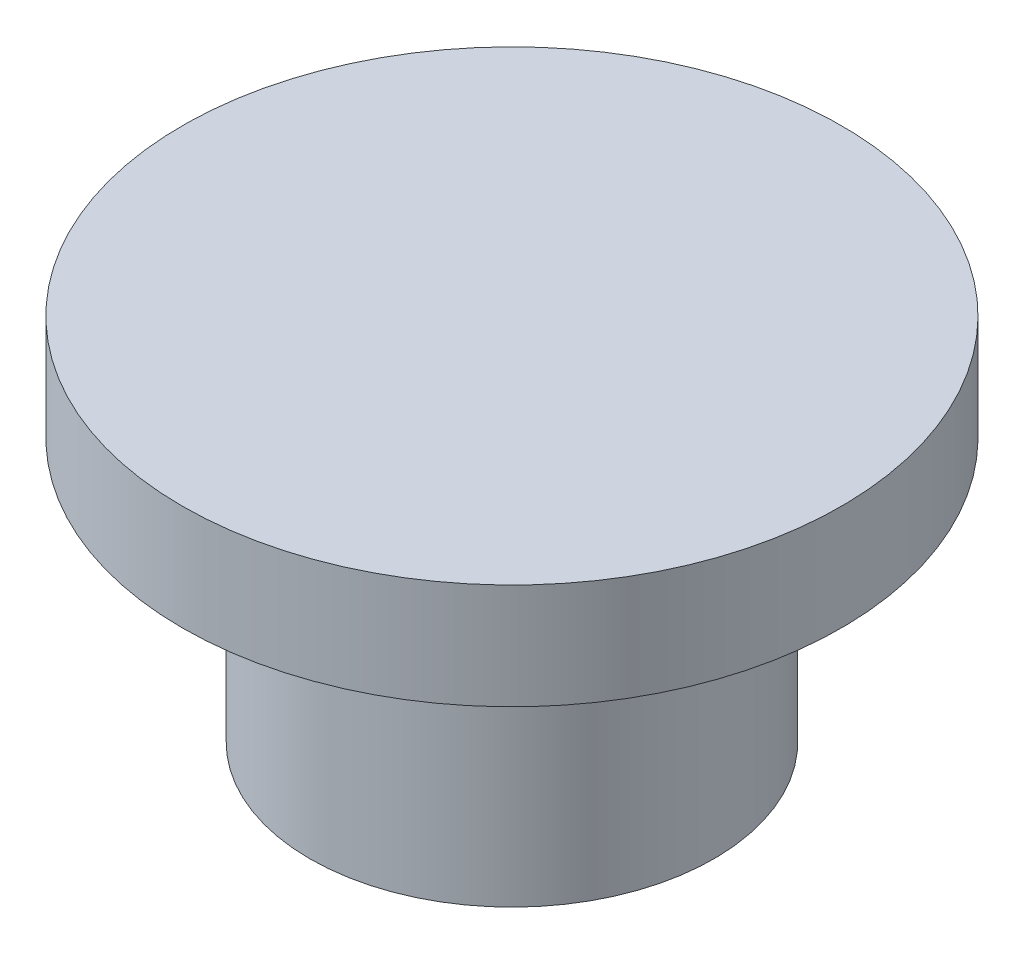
ISO-10303-21;
HEADER;
FILE_DESCRIPTION(('STEP AP214'),'2;1');
FILE_NAME('part.step','',(''),(''),'','','');
FILE_SCHEMA(('AUTOMOTIVE_DESIGN { 1 0 10303 214 1 1 1 1 }'));
ENDSEC;
DATA;
#1=APPLICATION_CONTEXT('core data for automotive mechanical design processes');
#2=APPLICATION_PROTOCOL_DEFINITION('international standard','automotive_design',2000,#1);
#3=PRODUCT_CONTEXT('',#1,'mechanical');
#4=PRODUCT('Part','Part','',(#3));
#5=PRODUCT_RELATED_PRODUCT_CATEGORY('part','',(#4));
#6=PRODUCT_DEFINITION_FORMATION('','',#4);
#7=PRODUCT_DEFINITION_CONTEXT('part definition',#1,'design');
#8=PRODUCT_DEFINITION('design','',#6,#7);
#9=PRODUCT_DEFINITION_SHAPE('','',#8);
#10=(LENGTH_UNIT() NAMED_UNIT(*) SI_UNIT(.MILLI.,.METRE.));
#11=(NAMED_UNIT(*) PLANE_ANGLE_UNIT() SI_UNIT($,.RADIAN.));
#12=(NAMED_UNIT(*) SI_UNIT($,.STERADIAN.) SOLID_ANGLE_UNIT());
#13=UNCERTAINTY_MEASURE_WITH_UNIT(LENGTH_MEASURE(1.E-05),#10,'distance_accuracy_value','');
#14=(GEOMETRIC_REPRESENTATION_CONTEXT(3) GLOBAL_UNCERTAINTY_ASSIGNED_CONTEXT((#13)) GLOBAL_UNIT_ASSIGNED_CONTEXT((#10,
#11,#12)) REPRESENTATION_CONTEXT('',''));
#15=CARTESIAN_POINT('',(0.,0.,0.));
#16=DIRECTION('',(0.,0.,1.));
#17=DIRECTION('',(1.,0.,0.));
#18=AXIS2_PLACEMENT_3D('',#15,#16,#17);
#19=CARTESIAN_POINT('',(0.,10.,0.));
#20=DIRECTION('',(0.,-1.,0.));
#21=DIRECTION('',(0.,0.,-1.));
#22=AXIS2_PLACEMENT_3D('',#19,#20,#21);
#23=CYLINDRICAL_SURFACE('',#22,7.665);
#24=CARTESIAN_POINT('',(0.,10.,0.));
#25=DIRECTION('',(0.,1.,0.));
#26=DIRECTION('',(0.,0.,1.));
#27=AXIS2_PLACEMENT_3D('',#24,#25,#26);
#28=CIRCLE('',#27,7.665);
#29=CARTESIAN_POINT('',(0.,10.,7.665));
#30=VERTEX_POINT('',#29);
#31=EDGE_CURVE('E10',#30,#30,#28,.T.);
#32=ORIENTED_EDGE('',*,*,#31,.F.);
#33=EDGE_LOOP('',(#32));
#34=FACE_BOUND('',#33,.T.);
#35=CARTESIAN_POINT('',(0.,0.,0.));
#36=DIRECTION('',(0.,1.,0.));
#37=DIRECTION('',(0.,0.,1.));
#38=AXIS2_PLACEMENT_3D('',#35,#36,#37);
#39=CIRCLE('',#38,7.665);
#40=CARTESIAN_POINT('',(0.,0.,7.665));
#41=VERTEX_POINT('',#40);
#42=EDGE_CURVE('E33',#41,#41,#39,.T.);
#43=ORIENTED_EDGE('',*,*,#42,.T.);
#44=EDGE_LOOP('',(#43));
#45=FACE_BOUND('',#44,.T.);
#46=ADVANCED_FACE('F30',(#34,#45),#23,.T.);
#47=CARTESIAN_POINT('',(0.,0.,0.));
#48=DIRECTION('',(0.,1.,0.));
#49=DIRECTION('',(0.,0.,1.));
#50=AXIS2_PLACEMENT_3D('',#47,#48,#49);
#51=PLANE('',#50);
#52=ORIENTED_EDGE('',*,*,#42,.F.);
#53=EDGE_LOOP('',(#52));
#54=FACE_BOUND('',#53,.T.);
#55=ADVANCED_FACE('F58',(#54),#51,.F.);
#56=CARTESIAN_POINT('',(0.,10.,0.));
#57=DIRECTION('',(0.,1.,0.));
#58=DIRECTION('',(0.,0.,1.));
#59=AXIS2_PLACEMENT_3D('',#56,#57,#58);
#60=PLANE('',#59);
#61=CARTESIAN_POINT('',(0.,10.,0.));
#62=DIRECTION('',(0.,1.,0.));
#63=DIRECTION('',(0.,0.,1.));
#64=AXIS2_PLACEMENT_3D('',#61,#62,#63);
#65=CIRCLE('',#64,12.5);
#66=CARTESIAN_POINT('',(0.,10.,12.5));
#67=VERTEX_POINT('',#66);
#68=EDGE_CURVE('E42',#67,#67,#65,.T.);
#69=ORIENTED_EDGE('',*,*,#68,.F.);
#70=EDGE_LOOP('',(#69));
#71=FACE_BOUND('',#70,.T.);
#72=ORIENTED_EDGE('',*,*,#31,.T.);
#73=EDGE_LOOP('',(#72));
#74=FACE_BOUND('',#73,.T.);
#75=ADVANCED_FACE('F53',(#71,#74),#60,.F.);
#76=CARTESIAN_POINT('',(0.,14.,0.));
#77=DIRECTION('',(0.,-1.,0.));
#78=DIRECTION('',(0.,0.,-1.));
#79=AXIS2_PLACEMENT_3D('',#76,#77,#78);
#80=CYLINDRICAL_SURFACE('',#79,12.5);
#81=CARTESIAN_POINT('',(0.,14.,0.));
#82=DIRECTION('',(0.,1.,0.));
#83=DIRECTION('',(0.,0.,1.));
#84=AXIS2_PLACEMENT_3D('',#81,#82,#83);
#85=CIRCLE('',#84,12.5);
#86=CARTESIAN_POINT('',(0.,14.,12.5));
#87=VERTEX_POINT('',#86);
#88=EDGE_CURVE('E40',#87,#87,#85,.T.);
#89=ORIENTED_EDGE('',*,*,#88,.F.);
#90=EDGE_LOOP('',(#89));
#91=FACE_BOUND('',#90,.T.);
#92=ORIENTED_EDGE('',*,*,#68,.T.);
#93=EDGE_LOOP('',(#92));
#94=FACE_BOUND('',#93,.T.);
#95=ADVANCED_FACE('F50',(#91,#94),#80,.T.);
#96=CARTESIAN_POINT('',(0.,14.,0.));
#97=DIRECTION('',(0.,1.,0.));
#98=DIRECTION('',(0.,0.,1.));
#99=AXIS2_PLACEMENT_3D('',#96,#97,#98);
#100=PLANE('',#99);
#101=ORIENTED_EDGE('',*,*,#88,.T.);
#102=EDGE_LOOP('',(#101));
#103=FACE_BOUND('',#102,.T.);
#104=ADVANCED_FACE('F48',(#103),#100,.T.);
#105=CLOSED_SHELL('',(#46,#55,#75,#95,#104));
#106=MANIFOLD_SOLID_BREP('B2',#105);
#107=ADVANCED_BREP_SHAPE_REPRESENTATION('',(#18,#106),#14);
#108=SHAPE_DEFINITION_REPRESENTATION(#9,#107);
ENDSEC;
END-ISO-10303-21;
